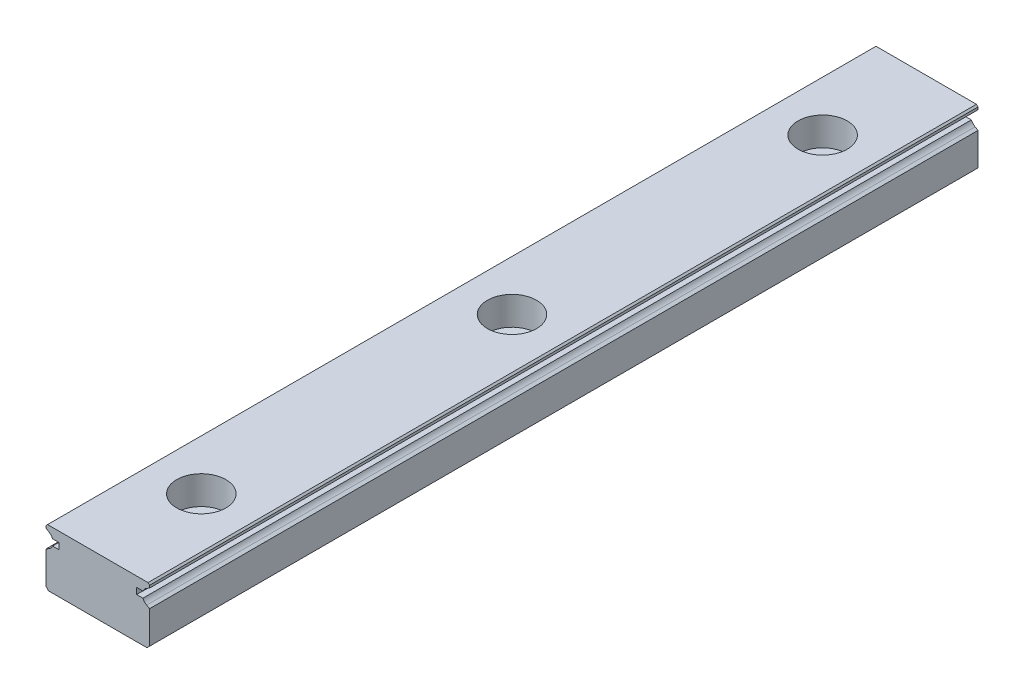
ISO-10303-21;
HEADER;
FILE_DESCRIPTION(('STEP AP214'),'2;1');
FILE_NAME('part.step','',(''),(''),'','','');
FILE_SCHEMA(('AUTOMOTIVE_DESIGN { 1 0 10303 214 1 1 1 1 }'));
ENDSEC;
DATA;
#1=APPLICATION_CONTEXT('core data for automotive mechanical design processes');
#2=APPLICATION_PROTOCOL_DEFINITION('international standard','automotive_design',2000,#1);
#3=PRODUCT_CONTEXT('',#1,'mechanical');
#4=PRODUCT('Part','Part','',(#3));
#5=PRODUCT_RELATED_PRODUCT_CATEGORY('part','',(#4));
#6=PRODUCT_DEFINITION_FORMATION('','',#4);
#7=PRODUCT_DEFINITION_CONTEXT('part definition',#1,'design');
#8=PRODUCT_DEFINITION('design','',#6,#7);
#9=PRODUCT_DEFINITION_SHAPE('','',#8);
#10=(LENGTH_UNIT() NAMED_UNIT(*) SI_UNIT(.MILLI.,.METRE.));
#11=(NAMED_UNIT(*) PLANE_ANGLE_UNIT() SI_UNIT($,.RADIAN.));
#12=(NAMED_UNIT(*) SI_UNIT($,.STERADIAN.) SOLID_ANGLE_UNIT());
#13=UNCERTAINTY_MEASURE_WITH_UNIT(LENGTH_MEASURE(1.E-05),#10,'distance_accuracy_value','');
#14=(GEOMETRIC_REPRESENTATION_CONTEXT(3) GLOBAL_UNCERTAINTY_ASSIGNED_CONTEXT((#13)) GLOBAL_UNIT_ASSIGNED_CONTEXT((#10,
#11,#12)) REPRESENTATION_CONTEXT('',''));
#15=CARTESIAN_POINT('',(0.,0.,0.));
#16=DIRECTION('',(0.,0.,1.));
#17=DIRECTION('',(1.,0.,0.));
#18=AXIS2_PLACEMENT_3D('',#15,#16,#17);
#19=CARTESIAN_POINT('',(-10.,10.7,80.));
#20=DIRECTION('',(1.,0.,0.));
#21=DIRECTION('',(0.,-1.,0.));
#22=AXIS2_PLACEMENT_3D('',#19,#20,#21);
#23=PLANE('',#22);
#24=DIRECTION('',(0.,-1.,0.));
#25=VECTOR('',#24,1.);
#26=CARTESIAN_POINT('',(-10.,10.7,-80.));
#27=LINE('',#26,#25);
#28=CARTESIAN_POINT('',(-10.,10.7,-80.));
#29=VERTEX_POINT('',#28);
#30=CARTESIAN_POINT('',(-10.,10.22385,-80.));
#31=VERTEX_POINT('',#30);
#32=EDGE_CURVE('E10',#29,#31,#27,.T.);
#33=ORIENTED_EDGE('',*,*,#32,.T.);
#34=DIRECTION('',(0.,0.,-1.));
#35=VECTOR('',#34,1.);
#36=CARTESIAN_POINT('',(-10.,10.22385,80.));
#37=LINE('',#36,#35);
#38=CARTESIAN_POINT('',(-10.,10.22385,80.));
#39=VERTEX_POINT('',#38);
#40=EDGE_CURVE('E41',#39,#31,#37,.T.);
#41=ORIENTED_EDGE('',*,*,#40,.F.);
#42=DIRECTION('',(0.,-1.,0.));
#43=VECTOR('',#42,1.);
#44=CARTESIAN_POINT('',(-10.,10.7,80.));
#45=LINE('',#44,#43);
#46=CARTESIAN_POINT('',(-10.,10.7,80.));
#47=VERTEX_POINT('',#46);
#48=EDGE_CURVE('E213',#47,#39,#45,.T.);
#49=ORIENTED_EDGE('',*,*,#48,.F.);
#50=DIRECTION('',(0.,0.,-1.));
#51=VECTOR('',#50,1.);
#52=CARTESIAN_POINT('',(-10.,10.7,80.));
#53=LINE('',#52,#51);
#54=EDGE_CURVE('E27',#47,#29,#53,.T.);
#55=ORIENTED_EDGE('',*,*,#54,.T.);
#56=EDGE_LOOP('',(#33,#41,#49,#55));
#57=FACE_BOUND('',#56,.T.);
#58=ADVANCED_FACE('F16',(#57),#23,.F.);
#59=CARTESIAN_POINT('',(-10.,10.22385,80.));
#60=DIRECTION('',(0.499987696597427,0.8660325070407,0.));
#61=DIRECTION('',(0.,0.,-1.));
#62=AXIS2_PLACEMENT_3D('',#59,#60,#61);
#63=PLANE('',#62);
#64=DIRECTION('',(0.8660325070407,-0.499987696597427,0.));
#65=VECTOR('',#64,1.);
#66=CARTESIAN_POINT('',(-10.,10.22385,-80.));
#67=LINE('',#66,#65);
#68=CARTESIAN_POINT('',(-9.44002153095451,9.90055688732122,-80.));
#69=VERTEX_POINT('',#68);
#70=EDGE_CURVE('E316',#31,#69,#67,.T.);
#71=ORIENTED_EDGE('',*,*,#70,.T.);
#72=DIRECTION('',(0.,0.,-1.));
#73=VECTOR('',#72,1.);
#74=CARTESIAN_POINT('',(-9.44002153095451,9.90055688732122,80.));
#75=LINE('',#74,#73);
#76=CARTESIAN_POINT('',(-9.44002153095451,9.90055688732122,80.));
#77=VERTEX_POINT('',#76);
#78=EDGE_CURVE('E250',#77,#69,#75,.T.);
#79=ORIENTED_EDGE('',*,*,#78,.F.);
#80=DIRECTION('',(0.8660325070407,-0.499987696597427,0.));
#81=VECTOR('',#80,1.);
#82=CARTESIAN_POINT('',(-10.,10.22385,80.));
#83=LINE('',#82,#81);
#84=EDGE_CURVE('E223',#39,#77,#83,.T.);
#85=ORIENTED_EDGE('',*,*,#84,.F.);
#86=ORIENTED_EDGE('',*,*,#40,.T.);
#87=EDGE_LOOP('',(#71,#79,#85,#86));
#88=FACE_BOUND('',#87,.T.);
#89=ADVANCED_FACE('F823',(#88),#63,.F.);
#90=CARTESIAN_POINT('',(-10.315,8.385,80.));
#91=DIRECTION('',(0.,0.,-1.));
#92=DIRECTION('',(-1.,0.,0.));
#93=AXIS2_PLACEMENT_3D('',#90,#91,#92);
#94=CYLINDRICAL_SURFACE('',#93,1.75);
#95=CARTESIAN_POINT('',(-10.315,8.385,-80.));
#96=DIRECTION('',(0.,0.,1.));
#97=DIRECTION('',(1.,0.,0.));
#98=AXIS2_PLACEMENT_3D('',#95,#96,#97);
#99=CIRCLE('',#98,1.75);
#100=CARTESIAN_POINT('',(-8.71772888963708,9.1,-80.));
#101=VERTEX_POINT('',#100);
#102=EDGE_CURVE('E270',#101,#69,#99,.T.);
#103=ORIENTED_EDGE('',*,*,#102,.F.);
#104=DIRECTION('',(0.,0.,-1.));
#105=VECTOR('',#104,1.);
#106=CARTESIAN_POINT('',(-8.71772888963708,9.1,80.));
#107=LINE('',#106,#105);
#108=CARTESIAN_POINT('',(-8.71772888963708,9.1,80.));
#109=VERTEX_POINT('',#108);
#110=EDGE_CURVE('E251',#109,#101,#107,.T.);
#111=ORIENTED_EDGE('',*,*,#110,.F.);
#112=CARTESIAN_POINT('',(-10.315,8.385,80.));
#113=DIRECTION('',(0.,0.,1.));
#114=DIRECTION('',(1.,0.,0.));
#115=AXIS2_PLACEMENT_3D('',#112,#113,#114);
#116=CIRCLE('',#115,1.75);
#117=EDGE_CURVE('E299',#109,#77,#116,.T.);
#118=ORIENTED_EDGE('',*,*,#117,.T.);
#119=ORIENTED_EDGE('',*,*,#78,.T.);
#120=EDGE_LOOP('',(#103,#111,#118,#119));
#121=FACE_BOUND('',#120,.T.);
#122=ADVANCED_FACE('F572',(#121),#94,.F.);
#123=CARTESIAN_POINT('',(-8.71772888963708,9.1,80.));
#124=DIRECTION('',(0.,1.,0.));
#125=DIRECTION('',(1.,0.,0.));
#126=AXIS2_PLACEMENT_3D('',#123,#124,#125);
#127=PLANE('',#126);
#128=DIRECTION('',(1.,0.,0.));
#129=VECTOR('',#128,1.);
#130=CARTESIAN_POINT('',(-8.71772888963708,9.1,-80.));
#131=LINE('',#130,#129);
#132=CARTESIAN_POINT('',(-7.5,9.1,-80.));
#133=VERTEX_POINT('',#132);
#134=EDGE_CURVE('E246',#101,#133,#131,.T.);
#135=ORIENTED_EDGE('',*,*,#134,.T.);
#136=DIRECTION('',(0.,0.,-1.));
#137=VECTOR('',#136,1.);
#138=CARTESIAN_POINT('',(-7.5,9.1,80.));
#139=LINE('',#138,#137);
#140=CARTESIAN_POINT('',(-7.5,9.1,80.));
#141=VERTEX_POINT('',#140);
#142=EDGE_CURVE('E355',#141,#133,#139,.T.);
#143=ORIENTED_EDGE('',*,*,#142,.F.);
#144=DIRECTION('',(1.,0.,0.));
#145=VECTOR('',#144,1.);
#146=CARTESIAN_POINT('',(-8.71772888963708,9.1,80.));
#147=LINE('',#146,#145);
#148=EDGE_CURVE('E219',#109,#141,#147,.T.);
#149=ORIENTED_EDGE('',*,*,#148,.F.);
#150=ORIENTED_EDGE('',*,*,#110,.T.);
#151=EDGE_LOOP('',(#135,#143,#149,#150));
#152=FACE_BOUND('',#151,.T.);
#153=ADVANCED_FACE('F18',(#152),#127,.F.);
#154=CARTESIAN_POINT('',(-7.5,9.1,80.));
#155=DIRECTION('',(1.,0.,0.));
#156=DIRECTION('',(0.,1.,0.));
#157=AXIS2_PLACEMENT_3D('',#154,#155,#156);
#158=PLANE('',#157);
#159=DIRECTION('',(0.,-1.,0.));
#160=VECTOR('',#159,1.);
#161=CARTESIAN_POINT('',(-7.5,9.1,-80.));
#162=LINE('',#161,#160);
#163=CARTESIAN_POINT('',(-7.5,7.9,-80.));
#164=VERTEX_POINT('',#163);
#165=EDGE_CURVE('E269',#133,#164,#162,.T.);
#166=ORIENTED_EDGE('',*,*,#165,.T.);
#167=DIRECTION('',(0.,0.,-1.));
#168=VECTOR('',#167,1.);
#169=CARTESIAN_POINT('',(-7.5,7.9,80.));
#170=LINE('',#169,#168);
#171=CARTESIAN_POINT('',(-7.5,7.9,80.));
#172=VERTEX_POINT('',#171);
#173=EDGE_CURVE('E356',#172,#164,#170,.T.);
#174=ORIENTED_EDGE('',*,*,#173,.F.);
#175=DIRECTION('',(0.,-1.,0.));
#176=VECTOR('',#175,1.);
#177=CARTESIAN_POINT('',(-7.5,9.1,80.));
#178=LINE('',#177,#176);
#179=EDGE_CURVE('E177',#141,#172,#178,.T.);
#180=ORIENTED_EDGE('',*,*,#179,.F.);
#181=ORIENTED_EDGE('',*,*,#142,.T.);
#182=EDGE_LOOP('',(#166,#174,#180,#181));
#183=FACE_BOUND('',#182,.T.);
#184=ADVANCED_FACE('F571',(#183),#158,.F.);
#185=CARTESIAN_POINT('',(-7.5,7.9,80.));
#186=DIRECTION('',(0.,-1.,0.));
#187=DIRECTION('',(-1.,0.,0.));
#188=AXIS2_PLACEMENT_3D('',#185,#186,#187);
#189=PLANE('',#188);
#190=DIRECTION('',(-1.,0.,0.));
#191=VECTOR('',#190,1.);
#192=CARTESIAN_POINT('',(-7.5,7.9,-80.));
#193=LINE('',#192,#191);
#194=CARTESIAN_POINT('',(-8.71772888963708,7.9,-80.));
#195=VERTEX_POINT('',#194);
#196=EDGE_CURVE('E351',#164,#195,#193,.T.);
#197=ORIENTED_EDGE('',*,*,#196,.T.);
#198=DIRECTION('',(0.,0.,-1.));
#199=VECTOR('',#198,1.);
#200=CARTESIAN_POINT('',(-8.71772888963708,7.9,80.));
#201=LINE('',#200,#199);
#202=CARTESIAN_POINT('',(-8.71772888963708,7.9,80.));
#203=VERTEX_POINT('',#202);
#204=EDGE_CURVE('E300',#203,#195,#201,.T.);
#205=ORIENTED_EDGE('',*,*,#204,.F.);
#206=DIRECTION('',(-1.,0.,0.));
#207=VECTOR('',#206,1.);
#208=CARTESIAN_POINT('',(-7.5,7.9,80.));
#209=LINE('',#208,#207);
#210=EDGE_CURVE('E420',#172,#203,#209,.T.);
#211=ORIENTED_EDGE('',*,*,#210,.F.);
#212=ORIENTED_EDGE('',*,*,#173,.T.);
#213=EDGE_LOOP('',(#197,#205,#211,#212));
#214=FACE_BOUND('',#213,.T.);
#215=ADVANCED_FACE('F628',(#214),#189,.F.);
#216=CARTESIAN_POINT('',(-10.315,8.615,80.));
#217=DIRECTION('',(0.,0.,-1.));
#218=DIRECTION('',(-1.,0.,0.));
#219=AXIS2_PLACEMENT_3D('',#216,#217,#218);
#220=CYLINDRICAL_SURFACE('',#219,1.75);
#221=CARTESIAN_POINT('',(-10.315,8.615,-80.));
#222=DIRECTION('',(0.,0.,1.));
#223=DIRECTION('',(1.,0.,0.));
#224=AXIS2_PLACEMENT_3D('',#221,#222,#223);
#225=CIRCLE('',#224,1.75);
#226=CARTESIAN_POINT('',(-9.4400215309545,7.09944311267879,-80.));
#227=VERTEX_POINT('',#226);
#228=EDGE_CURVE('E274',#227,#195,#225,.T.);
#229=ORIENTED_EDGE('',*,*,#228,.F.);
#230=DIRECTION('',(0.,0.,-1.));
#231=VECTOR('',#230,1.);
#232=CARTESIAN_POINT('',(-9.4400215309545,7.09944311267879,80.));
#233=LINE('',#232,#231);
#234=CARTESIAN_POINT('',(-9.4400215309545,7.09944311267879,80.));
#235=VERTEX_POINT('',#234);
#236=EDGE_CURVE('E189',#235,#227,#233,.T.);
#237=ORIENTED_EDGE('',*,*,#236,.F.);
#238=CARTESIAN_POINT('',(-10.315,8.615,80.));
#239=DIRECTION('',(0.,0.,1.));
#240=DIRECTION('',(1.,0.,0.));
#241=AXIS2_PLACEMENT_3D('',#238,#239,#240);
#242=CIRCLE('',#241,1.75);
#243=EDGE_CURVE('E304',#235,#203,#242,.T.);
#244=ORIENTED_EDGE('',*,*,#243,.T.);
#245=ORIENTED_EDGE('',*,*,#204,.T.);
#246=EDGE_LOOP('',(#229,#237,#244,#245));
#247=FACE_BOUND('',#246,.T.);
#248=ADVANCED_FACE('F605',(#247),#220,.F.);
#249=CARTESIAN_POINT('',(-9.4400215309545,7.09944311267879,80.));
#250=DIRECTION('',(0.499987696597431,-0.866032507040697,0.));
#251=DIRECTION('',(0.,0.,-1.));
#252=AXIS2_PLACEMENT_3D('',#249,#250,#251);
#253=PLANE('',#252);
#254=DIRECTION('',(-0.866032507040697,-0.499987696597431,0.));
#255=VECTOR('',#254,1.);
#256=CARTESIAN_POINT('',(-9.4400215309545,7.09944311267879,-80.));
#257=LINE('',#256,#255);
#258=CARTESIAN_POINT('',(-10.,6.77615,-80.));
#259=VERTEX_POINT('',#258);
#260=EDGE_CURVE('E305',#227,#259,#257,.T.);
#261=ORIENTED_EDGE('',*,*,#260,.T.);
#262=DIRECTION('',(0.,0.,-1.));
#263=VECTOR('',#262,1.);
#264=CARTESIAN_POINT('',(-10.,6.77615,80.));
#265=LINE('',#264,#263);
#266=CARTESIAN_POINT('',(-10.,6.77615,80.));
#267=VERTEX_POINT('',#266);
#268=EDGE_CURVE('E190',#267,#259,#265,.T.);
#269=ORIENTED_EDGE('',*,*,#268,.F.);
#270=DIRECTION('',(-0.866032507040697,-0.499987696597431,0.));
#271=VECTOR('',#270,1.);
#272=CARTESIAN_POINT('',(-9.4400215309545,7.09944311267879,80.));
#273=LINE('',#272,#271);
#274=EDGE_CURVE('E261',#235,#267,#273,.T.);
#275=ORIENTED_EDGE('',*,*,#274,.F.);
#276=ORIENTED_EDGE('',*,*,#236,.T.);
#277=EDGE_LOOP('',(#261,#269,#275,#276));
#278=FACE_BOUND('',#277,.T.);
#279=ADVANCED_FACE('F599',(#278),#253,.F.);
#280=CARTESIAN_POINT('',(-10.,6.77615,80.));
#281=DIRECTION('',(1.,0.,0.));
#282=DIRECTION('',(0.,1.,0.));
#283=AXIS2_PLACEMENT_3D('',#280,#281,#282);
#284=PLANE('',#283);
#285=DIRECTION('',(0.,-1.,0.));
#286=VECTOR('',#285,1.);
#287=CARTESIAN_POINT('',(-10.,6.77615,-80.));
#288=LINE('',#287,#286);
#289=CARTESIAN_POINT('',(-10.,0.5,-80.));
#290=VERTEX_POINT('',#289);
#291=EDGE_CURVE('E185',#259,#290,#288,.T.);
#292=ORIENTED_EDGE('',*,*,#291,.T.);
#293=DIRECTION('',(0.,0.,-1.));
#294=VECTOR('',#293,1.);
#295=CARTESIAN_POINT('',(-10.,0.5,80.));
#296=LINE('',#295,#294);
#297=CARTESIAN_POINT('',(-10.,0.5,80.));
#298=VERTEX_POINT('',#297);
#299=EDGE_CURVE('E218',#298,#290,#296,.T.);
#300=ORIENTED_EDGE('',*,*,#299,.F.);
#301=DIRECTION('',(0.,-1.,0.));
#302=VECTOR('',#301,1.);
#303=CARTESIAN_POINT('',(-10.,6.77615,80.));
#304=LINE('',#303,#302);
#305=EDGE_CURVE('E257',#267,#298,#304,.T.);
#306=ORIENTED_EDGE('',*,*,#305,.F.);
#307=ORIENTED_EDGE('',*,*,#268,.T.);
#308=EDGE_LOOP('',(#292,#300,#306,#307));
#309=FACE_BOUND('',#308,.T.);
#310=ADVANCED_FACE('F604',(#309),#284,.F.);
#311=CARTESIAN_POINT('',(-10.,0.5,80.));
#312=DIRECTION('',(0.707106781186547,0.707106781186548,0.));
#313=DIRECTION('',(0.,0.,-1.));
#314=AXIS2_PLACEMENT_3D('',#311,#312,#313);
#315=PLANE('',#314);
#316=DIRECTION('',(0.707106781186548,-0.707106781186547,0.));
#317=VECTOR('',#316,1.);
#318=CARTESIAN_POINT('',(-10.,0.5,-80.));
#319=LINE('',#318,#317);
#320=CARTESIAN_POINT('',(-9.5,0.,-80.));
#321=VERTEX_POINT('',#320);
#322=EDGE_CURVE('E357',#290,#321,#319,.T.);
#323=ORIENTED_EDGE('',*,*,#322,.T.);
#324=DIRECTION('',(0.,0.,-1.));
#325=VECTOR('',#324,1.);
#326=CARTESIAN_POINT('',(-9.5,0.,80.));
#327=LINE('',#326,#325);
#328=CARTESIAN_POINT('',(-9.5,0.,80.));
#329=VERTEX_POINT('',#328);
#330=EDGE_CURVE('E182',#329,#321,#327,.T.);
#331=ORIENTED_EDGE('',*,*,#330,.F.);
#332=DIRECTION('',(0.707106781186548,-0.707106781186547,0.));
#333=VECTOR('',#332,1.);
#334=CARTESIAN_POINT('',(-10.,0.5,80.));
#335=LINE('',#334,#333);
#336=EDGE_CURVE('E262',#298,#329,#335,.T.);
#337=ORIENTED_EDGE('',*,*,#336,.F.);
#338=ORIENTED_EDGE('',*,*,#299,.T.);
#339=EDGE_LOOP('',(#323,#331,#337,#338));
#340=FACE_BOUND('',#339,.T.);
#341=ADVANCED_FACE('F592',(#340),#315,.F.);
#342=CARTESIAN_POINT('',(-9.5,0.,80.));
#343=DIRECTION('',(0.,1.,0.));
#344=DIRECTION('',(1.,0.,0.));
#345=AXIS2_PLACEMENT_3D('',#342,#343,#344);
#346=PLANE('',#345);
#347=CARTESIAN_POINT('',(0.,0.,0.));
#348=DIRECTION('',(0.,-1.,0.));
#349=DIRECTION('',(0.,0.,-1.));
#350=AXIS2_PLACEMENT_3D('',#347,#348,#349);
#351=CIRCLE('',#350,3.);
#352=CARTESIAN_POINT('',(0.,0.,-3.));
#353=VERTEX_POINT('',#352);
#354=EDGE_CURVE('E283',#353,#353,#351,.T.);
#355=ORIENTED_EDGE('',*,*,#354,.F.);
#356=EDGE_LOOP('',(#355));
#357=FACE_BOUND('',#356,.T.);
#358=CARTESIAN_POINT('',(0.,0.,60.));
#359=DIRECTION('',(0.,-1.,0.));
#360=DIRECTION('',(0.,0.,-1.));
#361=AXIS2_PLACEMENT_3D('',#358,#359,#360);
#362=CIRCLE('',#361,3.);
#363=CARTESIAN_POINT('',(0.,0.,57.));
#364=VERTEX_POINT('',#363);
#365=EDGE_CURVE('E1074',#364,#364,#362,.T.);
#366=ORIENTED_EDGE('',*,*,#365,.F.);
#367=EDGE_LOOP('',(#366));
#368=FACE_BOUND('',#367,.T.);
#369=CARTESIAN_POINT('',(0.,0.,-60.));
#370=DIRECTION('',(0.,-1.,0.));
#371=DIRECTION('',(0.,0.,-1.));
#372=AXIS2_PLACEMENT_3D('',#369,#370,#371);
#373=CIRCLE('',#372,3.);
#374=CARTESIAN_POINT('',(0.,0.,-63.));
#375=VERTEX_POINT('',#374);
#376=EDGE_CURVE('E156',#375,#375,#373,.T.);
#377=ORIENTED_EDGE('',*,*,#376,.F.);
#378=EDGE_LOOP('',(#377));
#379=FACE_BOUND('',#378,.T.);
#380=DIRECTION('',(1.,0.,0.));
#381=VECTOR('',#380,1.);
#382=CARTESIAN_POINT('',(-9.5,0.,-80.));
#383=LINE('',#382,#381);
#384=CARTESIAN_POINT('',(9.5,0.,-80.));
#385=VERTEX_POINT('',#384);
#386=EDGE_CURVE('E214',#321,#385,#383,.T.);
#387=ORIENTED_EDGE('',*,*,#386,.T.);
#388=DIRECTION('',(0.,0.,-1.));
#389=VECTOR('',#388,1.);
#390=CARTESIAN_POINT('',(9.5,0.,80.));
#391=LINE('',#390,#389);
#392=CARTESIAN_POINT('',(9.5,0.,80.));
#393=VERTEX_POINT('',#392);
#394=EDGE_CURVE('E183',#393,#385,#391,.T.);
#395=ORIENTED_EDGE('',*,*,#394,.F.);
#396=DIRECTION('',(1.,0.,0.));
#397=VECTOR('',#396,1.);
#398=CARTESIAN_POINT('',(-9.5,0.,80.));
#399=LINE('',#398,#397);
#400=EDGE_CURVE('E288',#329,#393,#399,.T.);
#401=ORIENTED_EDGE('',*,*,#400,.F.);
#402=ORIENTED_EDGE('',*,*,#330,.T.);
#403=EDGE_LOOP('',(#387,#395,#401,#402));
#404=FACE_BOUND('',#403,.T.);
#405=ADVANCED_FACE('F157',(#357,#368,#379,#404),#346,.F.);
#406=CARTESIAN_POINT('',(9.5,0.,80.));
#407=DIRECTION('',(-0.707106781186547,0.707106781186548,0.));
#408=DIRECTION('',(0.,0.,1.));
#409=AXIS2_PLACEMENT_3D('',#406,#407,#408);
#410=PLANE('',#409);
#411=DIRECTION('',(0.707106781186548,0.707106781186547,0.));
#412=VECTOR('',#411,1.);
#413=CARTESIAN_POINT('',(9.5,0.,-80.));
#414=LINE('',#413,#412);
#415=CARTESIAN_POINT('',(10.,0.5,-80.));
#416=VERTEX_POINT('',#415);
#417=EDGE_CURVE('E179',#385,#416,#414,.T.);
#418=ORIENTED_EDGE('',*,*,#417,.T.);
#419=DIRECTION('',(0.,0.,-1.));
#420=VECTOR('',#419,1.);
#421=CARTESIAN_POINT('',(10.,0.5,80.));
#422=LINE('',#421,#420);
#423=CARTESIAN_POINT('',(10.,0.5,80.));
#424=VERTEX_POINT('',#423);
#425=EDGE_CURVE('E256',#424,#416,#422,.T.);
#426=ORIENTED_EDGE('',*,*,#425,.F.);
#427=DIRECTION('',(0.707106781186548,0.707106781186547,0.));
#428=VECTOR('',#427,1.);
#429=CARTESIAN_POINT('',(9.5,0.,80.));
#430=LINE('',#429,#428);
#431=EDGE_CURVE('E284',#393,#424,#430,.T.);
#432=ORIENTED_EDGE('',*,*,#431,.F.);
#433=ORIENTED_EDGE('',*,*,#394,.T.);
#434=EDGE_LOOP('',(#418,#426,#432,#433));
#435=FACE_BOUND('',#434,.T.);
#436=ADVANCED_FACE('F591',(#435),#410,.F.);
#437=CARTESIAN_POINT('',(10.,0.5,80.));
#438=DIRECTION('',(-1.,0.,0.));
#439=DIRECTION('',(0.,0.,1.));
#440=AXIS2_PLACEMENT_3D('',#437,#438,#439);
#441=PLANE('',#440);
#442=DIRECTION('',(0.,1.,0.));
#443=VECTOR('',#442,1.);
#444=CARTESIAN_POINT('',(10.,0.5,-80.));
#445=LINE('',#444,#443);
#446=CARTESIAN_POINT('',(10.,6.77615,-80.));
#447=VERTEX_POINT('',#446);
#448=EDGE_CURVE('E252',#416,#447,#445,.T.);
#449=ORIENTED_EDGE('',*,*,#448,.T.);
#450=DIRECTION('',(0.,0.,-1.));
#451=VECTOR('',#450,1.);
#452=CARTESIAN_POINT('',(10.,6.77615,80.));
#453=LINE('',#452,#451);
#454=CARTESIAN_POINT('',(10.,6.77615,80.));
#455=VERTEX_POINT('',#454);
#456=EDGE_CURVE('E224',#455,#447,#453,.T.);
#457=ORIENTED_EDGE('',*,*,#456,.F.);
#458=DIRECTION('',(0.,1.,0.));
#459=VECTOR('',#458,1.);
#460=CARTESIAN_POINT('',(10.,0.5,80.));
#461=LINE('',#460,#459);
#462=EDGE_CURVE('E289',#424,#455,#461,.T.);
#463=ORIENTED_EDGE('',*,*,#462,.F.);
#464=ORIENTED_EDGE('',*,*,#425,.T.);
#465=EDGE_LOOP('',(#449,#457,#463,#464));
#466=FACE_BOUND('',#465,.T.);
#467=ADVANCED_FACE('F636',(#466),#441,.F.);
#468=CARTESIAN_POINT('',(10.,6.77615,80.));
#469=DIRECTION('',(-0.499987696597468,-0.866032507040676,0.));
#470=DIRECTION('',(-0.866032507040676,0.499987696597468,0.));
#471=AXIS2_PLACEMENT_3D('',#468,#469,#470);
#472=PLANE('',#471);
#473=DIRECTION('',(-0.866032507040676,0.499987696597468,0.));
#474=VECTOR('',#473,1.);
#475=CARTESIAN_POINT('',(10.,6.77615,-80.));
#476=LINE('',#475,#474);
#477=CARTESIAN_POINT('',(9.44002153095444,7.09944311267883,-80.));
#478=VERTEX_POINT('',#477);
#479=EDGE_CURVE('E227',#447,#478,#476,.T.);
#480=ORIENTED_EDGE('',*,*,#479,.T.);
#481=DIRECTION('',(0.,0.,-1.));
#482=VECTOR('',#481,1.);
#483=CARTESIAN_POINT('',(9.44002153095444,7.09944311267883,80.));
#484=LINE('',#483,#482);
#485=CARTESIAN_POINT('',(9.44002153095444,7.09944311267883,80.));
#486=VERTEX_POINT('',#485);
#487=EDGE_CURVE('E408',#486,#478,#484,.T.);
#488=ORIENTED_EDGE('',*,*,#487,.F.);
#489=DIRECTION('',(-0.866032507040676,0.499987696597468,0.));
#490=VECTOR('',#489,1.);
#491=CARTESIAN_POINT('',(10.,6.77615,80.));
#492=LINE('',#491,#490);
#493=EDGE_CURVE('E244',#455,#486,#492,.T.);
#494=ORIENTED_EDGE('',*,*,#493,.F.);
#495=ORIENTED_EDGE('',*,*,#456,.T.);
#496=EDGE_LOOP('',(#480,#488,#494,#495));
#497=FACE_BOUND('',#496,.T.);
#498=ADVANCED_FACE('F434',(#497),#472,.F.);
#499=CARTESIAN_POINT('',(10.315,8.615,80.));
#500=DIRECTION('',(0.,0.,-1.));
#501=DIRECTION('',(-1.,0.,0.));
#502=AXIS2_PLACEMENT_3D('',#499,#500,#501);
#503=CYLINDRICAL_SURFACE('',#502,1.75);
#504=CARTESIAN_POINT('',(10.315,8.615,-80.));
#505=DIRECTION('',(0.,0.,1.));
#506=DIRECTION('',(1.,0.,0.));
#507=AXIS2_PLACEMENT_3D('',#504,#505,#506);
#508=CIRCLE('',#507,1.75);
#509=CARTESIAN_POINT('',(8.71772888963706,7.9,-80.));
#510=VERTEX_POINT('',#509);
#511=EDGE_CURVE('E315',#510,#478,#508,.T.);
#512=ORIENTED_EDGE('',*,*,#511,.F.);
#513=DIRECTION('',(0.,0.,-1.));
#514=VECTOR('',#513,1.);
#515=CARTESIAN_POINT('',(8.71772888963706,7.9,80.));
#516=LINE('',#515,#514);
#517=CARTESIAN_POINT('',(8.71772888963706,7.9,80.));
#518=VERTEX_POINT('',#517);
#519=EDGE_CURVE('E229',#518,#510,#516,.T.);
#520=ORIENTED_EDGE('',*,*,#519,.F.);
#521=CARTESIAN_POINT('',(10.315,8.615,80.));
#522=DIRECTION('',(0.,0.,1.));
#523=DIRECTION('',(1.,0.,0.));
#524=AXIS2_PLACEMENT_3D('',#521,#522,#523);
#525=CIRCLE('',#524,1.75);
#526=EDGE_CURVE('E228',#518,#486,#525,.T.);
#527=ORIENTED_EDGE('',*,*,#526,.T.);
#528=ORIENTED_EDGE('',*,*,#487,.T.);
#529=EDGE_LOOP('',(#512,#520,#527,#528));
#530=FACE_BOUND('',#529,.T.);
#531=ADVANCED_FACE('F427',(#530),#503,.F.);
#532=CARTESIAN_POINT('',(8.71772888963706,7.9,80.));
#533=DIRECTION('',(0.,-1.,0.));
#534=DIRECTION('',(-1.,0.,0.));
#535=AXIS2_PLACEMENT_3D('',#532,#533,#534);
#536=PLANE('',#535);
#537=DIRECTION('',(-1.,0.,0.));
#538=VECTOR('',#537,1.);
#539=CARTESIAN_POINT('',(8.71772888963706,7.9,-80.));
#540=LINE('',#539,#538);
#541=CARTESIAN_POINT('',(7.5,7.9,-80.));
#542=VERTEX_POINT('',#541);
#543=EDGE_CURVE('E233',#510,#542,#540,.T.);
#544=ORIENTED_EDGE('',*,*,#543,.T.);
#545=DIRECTION('',(0.,0.,-1.));
#546=VECTOR('',#545,1.);
#547=CARTESIAN_POINT('',(7.5,7.9,80.));
#548=LINE('',#547,#546);
#549=CARTESIAN_POINT('',(7.5,7.9,80.));
#550=VERTEX_POINT('',#549);
#551=EDGE_CURVE('E207',#550,#542,#548,.T.);
#552=ORIENTED_EDGE('',*,*,#551,.F.);
#553=DIRECTION('',(-1.,0.,0.));
#554=VECTOR('',#553,1.);
#555=CARTESIAN_POINT('',(8.71772888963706,7.9,80.));
#556=LINE('',#555,#554);
#557=EDGE_CURVE('E240',#518,#550,#556,.T.);
#558=ORIENTED_EDGE('',*,*,#557,.F.);
#559=ORIENTED_EDGE('',*,*,#519,.T.);
#560=EDGE_LOOP('',(#544,#552,#558,#559));
#561=FACE_BOUND('',#560,.T.);
#562=ADVANCED_FACE('F445',(#561),#536,.F.);
#563=CARTESIAN_POINT('',(7.5,7.9,80.));
#564=DIRECTION('',(-1.,0.,0.));
#565=DIRECTION('',(0.,0.,1.));
#566=AXIS2_PLACEMENT_3D('',#563,#564,#565);
#567=PLANE('',#566);
#568=DIRECTION('',(0.,1.,0.));
#569=VECTOR('',#568,1.);
#570=CARTESIAN_POINT('',(7.5,7.9,-80.));
#571=LINE('',#570,#569);
#572=CARTESIAN_POINT('',(7.5,9.1,-80.));
#573=VERTEX_POINT('',#572);
#574=EDGE_CURVE('E234',#542,#573,#571,.T.);
#575=ORIENTED_EDGE('',*,*,#574,.T.);
#576=DIRECTION('',(0.,0.,-1.));
#577=VECTOR('',#576,1.);
#578=CARTESIAN_POINT('',(7.5,9.1,80.));
#579=LINE('',#578,#577);
#580=CARTESIAN_POINT('',(7.5,9.1,80.));
#581=VERTEX_POINT('',#580);
#582=EDGE_CURVE('E208',#581,#573,#579,.T.);
#583=ORIENTED_EDGE('',*,*,#582,.F.);
#584=DIRECTION('',(0.,1.,0.));
#585=VECTOR('',#584,1.);
#586=CARTESIAN_POINT('',(7.5,7.9,80.));
#587=LINE('',#586,#585);
#588=EDGE_CURVE('E245',#550,#581,#587,.T.);
#589=ORIENTED_EDGE('',*,*,#588,.F.);
#590=ORIENTED_EDGE('',*,*,#551,.T.);
#591=EDGE_LOOP('',(#575,#583,#589,#590));
#592=FACE_BOUND('',#591,.T.);
#593=ADVANCED_FACE('F697',(#592),#567,.F.);
#594=CARTESIAN_POINT('',(7.5,9.1,80.));
#595=DIRECTION('',(0.,1.,0.));
#596=DIRECTION('',(1.,0.,0.));
#597=AXIS2_PLACEMENT_3D('',#594,#595,#596);
#598=PLANE('',#597);
#599=DIRECTION('',(1.,0.,0.));
#600=VECTOR('',#599,1.);
#601=CARTESIAN_POINT('',(7.5,9.1,-80.));
#602=LINE('',#601,#600);
#603=CARTESIAN_POINT('',(8.71772888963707,9.1,-80.));
#604=VERTEX_POINT('',#603);
#605=EDGE_CURVE('E203',#573,#604,#602,.T.);
#606=ORIENTED_EDGE('',*,*,#605,.T.);
#607=DIRECTION('',(0.,0.,-1.));
#608=VECTOR('',#607,1.);
#609=CARTESIAN_POINT('',(8.71772888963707,9.1,80.));
#610=LINE('',#609,#608);
#611=CARTESIAN_POINT('',(8.71772888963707,9.1,80.));
#612=VERTEX_POINT('',#611);
#613=EDGE_CURVE('E239',#612,#604,#610,.T.);
#614=ORIENTED_EDGE('',*,*,#613,.F.);
#615=DIRECTION('',(1.,0.,0.));
#616=VECTOR('',#615,1.);
#617=CARTESIAN_POINT('',(7.5,9.1,80.));
#618=LINE('',#617,#616);
#619=EDGE_CURVE('E330',#581,#612,#618,.T.);
#620=ORIENTED_EDGE('',*,*,#619,.F.);
#621=ORIENTED_EDGE('',*,*,#582,.T.);
#622=EDGE_LOOP('',(#606,#614,#620,#621));
#623=FACE_BOUND('',#622,.T.);
#624=ADVANCED_FACE('F691',(#623),#598,.F.);
#625=CARTESIAN_POINT('',(10.315,8.385,80.));
#626=DIRECTION('',(0.,0.,-1.));
#627=DIRECTION('',(-1.,0.,0.));
#628=AXIS2_PLACEMENT_3D('',#625,#626,#627);
#629=CYLINDRICAL_SURFACE('',#628,1.75);
#630=CARTESIAN_POINT('',(10.315,8.385,-80.));
#631=DIRECTION('',(0.,0.,1.));
#632=DIRECTION('',(1.,0.,0.));
#633=AXIS2_PLACEMENT_3D('',#630,#631,#632);
#634=CIRCLE('',#633,1.75);
#635=CARTESIAN_POINT('',(9.44002153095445,9.90055688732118,-80.));
#636=VERTEX_POINT('',#635);
#637=EDGE_CURVE('E202',#636,#604,#634,.T.);
#638=ORIENTED_EDGE('',*,*,#637,.F.);
#639=DIRECTION('',(0.,0.,-1.));
#640=VECTOR('',#639,1.);
#641=CARTESIAN_POINT('',(9.44002153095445,9.90055688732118,80.));
#642=LINE('',#641,#640);
#643=CARTESIAN_POINT('',(9.44002153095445,9.90055688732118,80.));
#644=VERTEX_POINT('',#643);
#645=EDGE_CURVE('E349',#644,#636,#642,.T.);
#646=ORIENTED_EDGE('',*,*,#645,.F.);
#647=CARTESIAN_POINT('',(10.315,8.385,80.));
#648=DIRECTION('',(0.,0.,1.));
#649=DIRECTION('',(1.,0.,0.));
#650=AXIS2_PLACEMENT_3D('',#647,#648,#649);
#651=CIRCLE('',#650,1.75);
#652=EDGE_CURVE('E235',#644,#612,#651,.T.);
#653=ORIENTED_EDGE('',*,*,#652,.T.);
#654=ORIENTED_EDGE('',*,*,#613,.T.);
#655=EDGE_LOOP('',(#638,#646,#653,#654));
#656=FACE_BOUND('',#655,.T.);
#657=ADVANCED_FACE('F696',(#656),#629,.F.);
#658=CARTESIAN_POINT('',(9.44002153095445,9.90055688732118,80.));
#659=DIRECTION('',(-0.499987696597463,0.866032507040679,0.));
#660=DIRECTION('',(0.,0.,1.));
#661=AXIS2_PLACEMENT_3D('',#658,#659,#660);
#662=PLANE('',#661);
#663=DIRECTION('',(0.866032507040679,0.499987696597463,0.));
#664=VECTOR('',#663,1.);
#665=CARTESIAN_POINT('',(9.44002153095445,9.90055688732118,-80.));
#666=LINE('',#665,#664);
#667=CARTESIAN_POINT('',(10.,10.22385,-80.));
#668=VERTEX_POINT('',#667);
#669=EDGE_CURVE('E340',#636,#668,#666,.T.);
#670=ORIENTED_EDGE('',*,*,#669,.T.);
#671=DIRECTION('',(0.,0.,-1.));
#672=VECTOR('',#671,1.);
#673=CARTESIAN_POINT('',(10.,10.22385,80.));
#674=LINE('',#673,#672);
#675=CARTESIAN_POINT('',(10.,10.22385,80.));
#676=VERTEX_POINT('',#675);
#677=EDGE_CURVE('E350',#676,#668,#674,.T.);
#678=ORIENTED_EDGE('',*,*,#677,.F.);
#679=DIRECTION('',(0.866032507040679,0.499987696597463,0.));
#680=VECTOR('',#679,1.);
#681=CARTESIAN_POINT('',(9.44002153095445,9.90055688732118,80.));
#682=LINE('',#681,#680);
#683=EDGE_CURVE('E195',#644,#676,#682,.T.);
#684=ORIENTED_EDGE('',*,*,#683,.F.);
#685=ORIENTED_EDGE('',*,*,#645,.T.);
#686=EDGE_LOOP('',(#670,#678,#684,#685));
#687=FACE_BOUND('',#686,.T.);
#688=ADVANCED_FACE('F733',(#687),#662,.F.);
#689=CARTESIAN_POINT('',(10.,10.22385,80.));
#690=DIRECTION('',(-1.,0.,0.));
#691=DIRECTION('',(0.,1.,0.));
#692=AXIS2_PLACEMENT_3D('',#689,#690,#691);
#693=PLANE('',#692);
#694=DIRECTION('',(0.,1.,0.));
#695=VECTOR('',#694,1.);
#696=CARTESIAN_POINT('',(10.,10.22385,-80.));
#697=LINE('',#696,#695);
#698=CARTESIAN_POINT('',(10.,10.7,-80.));
#699=VERTEX_POINT('',#698);
#700=EDGE_CURVE('E345',#668,#699,#697,.T.);
#701=ORIENTED_EDGE('',*,*,#700,.T.);
#702=DIRECTION('',(0.,0.,-1.));
#703=VECTOR('',#702,1.);
#704=CARTESIAN_POINT('',(10.,10.7,80.));
#705=LINE('',#704,#703);
#706=CARTESIAN_POINT('',(10.,10.7,80.));
#707=VERTEX_POINT('',#706);
#708=EDGE_CURVE('E20',#707,#699,#705,.T.);
#709=ORIENTED_EDGE('',*,*,#708,.F.);
#710=DIRECTION('',(0.,1.,0.));
#711=VECTOR('',#710,1.);
#712=CARTESIAN_POINT('',(10.,10.22385,80.));
#713=LINE('',#712,#711);
#714=EDGE_CURVE('E191',#676,#707,#713,.T.);
#715=ORIENTED_EDGE('',*,*,#714,.F.);
#716=ORIENTED_EDGE('',*,*,#677,.T.);
#717=EDGE_LOOP('',(#701,#709,#715,#716));
#718=FACE_BOUND('',#717,.T.);
#719=ADVANCED_FACE('F648',(#718),#693,.F.);
#720=CARTESIAN_POINT('',(10.,10.7,80.));
#721=DIRECTION('',(-0.707106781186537,-0.707106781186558,0.));
#722=DIRECTION('',(-0.707106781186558,0.707106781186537,0.));
#723=AXIS2_PLACEMENT_3D('',#720,#721,#722);
#724=PLANE('',#723);
#725=DIRECTION('',(-0.707106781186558,0.707106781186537,0.));
#726=VECTOR('',#725,1.);
#727=CARTESIAN_POINT('',(10.,10.7,-80.));
#728=LINE('',#727,#726);
#729=CARTESIAN_POINT('',(9.7,11.,-80.));
#730=VERTEX_POINT('',#729);
#731=EDGE_CURVE('E367',#699,#730,#728,.T.);
#732=ORIENTED_EDGE('',*,*,#731,.T.);
#733=DIRECTION('',(0.,0.,-1.));
#734=VECTOR('',#733,1.);
#735=CARTESIAN_POINT('',(9.7,11.,80.));
#736=LINE('',#735,#734);
#737=CARTESIAN_POINT('',(9.7,11.,80.));
#738=VERTEX_POINT('',#737);
#739=EDGE_CURVE('E295',#738,#730,#736,.T.);
#740=ORIENTED_EDGE('',*,*,#739,.F.);
#741=DIRECTION('',(-0.707106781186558,0.707106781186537,0.));
#742=VECTOR('',#741,1.);
#743=CARTESIAN_POINT('',(10.,10.7,80.));
#744=LINE('',#743,#742);
#745=EDGE_CURVE('E196',#707,#738,#744,.T.);
#746=ORIENTED_EDGE('',*,*,#745,.F.);
#747=ORIENTED_EDGE('',*,*,#708,.T.);
#748=EDGE_LOOP('',(#732,#740,#746,#747));
#749=FACE_BOUND('',#748,.T.);
#750=ADVANCED_FACE('F642',(#749),#724,.F.);
#751=CARTESIAN_POINT('',(9.7,11.,80.));
#752=DIRECTION('',(0.,-1.,0.));
#753=DIRECTION('',(0.,0.,-1.));
#754=AXIS2_PLACEMENT_3D('',#751,#752,#753);
#755=PLANE('',#754);
#756=CARTESIAN_POINT('',(0.,11.,0.));
#757=DIRECTION('',(0.,-1.,0.));
#758=DIRECTION('',(0.,0.,-1.));
#759=AXIS2_PLACEMENT_3D('',#756,#757,#758);
#760=CIRCLE('',#759,4.75);
#761=CARTESIAN_POINT('',(0.,11.,-4.75));
#762=VERTEX_POINT('',#761);
#763=EDGE_CURVE('E344',#762,#762,#760,.T.);
#764=ORIENTED_EDGE('',*,*,#763,.T.);
#765=EDGE_LOOP('',(#764));
#766=FACE_BOUND('',#765,.T.);
#767=CARTESIAN_POINT('',(0.,11.,60.));
#768=DIRECTION('',(0.,-1.,0.));
#769=DIRECTION('',(0.,0.,-1.));
#770=AXIS2_PLACEMENT_3D('',#767,#768,#769);
#771=CIRCLE('',#770,4.75);
#772=CARTESIAN_POINT('',(0.,11.,55.25));
#773=VERTEX_POINT('',#772);
#774=EDGE_CURVE('E311',#773,#773,#771,.T.);
#775=ORIENTED_EDGE('',*,*,#774,.T.);
#776=EDGE_LOOP('',(#775));
#777=FACE_BOUND('',#776,.T.);
#778=CARTESIAN_POINT('',(0.,11.,-60.));
#779=DIRECTION('',(0.,-1.,0.));
#780=DIRECTION('',(0.,0.,-1.));
#781=AXIS2_PLACEMENT_3D('',#778,#779,#780);
#782=CIRCLE('',#781,4.75);
#783=CARTESIAN_POINT('',(0.,11.,-64.75));
#784=VERTEX_POINT('',#783);
#785=EDGE_CURVE('E294',#784,#784,#782,.T.);
#786=ORIENTED_EDGE('',*,*,#785,.T.);
#787=EDGE_LOOP('',(#786));
#788=FACE_BOUND('',#787,.T.);
#789=DIRECTION('',(-1.,0.,0.));
#790=VECTOR('',#789,1.);
#791=CARTESIAN_POINT('',(9.7,11.,-80.));
#792=LINE('',#791,#790);
#793=CARTESIAN_POINT('',(-9.7,11.,-80.));
#794=VERTEX_POINT('',#793);
#795=EDGE_CURVE('E290',#730,#794,#792,.T.);
#796=ORIENTED_EDGE('',*,*,#795,.T.);
#797=DIRECTION('',(0.,0.,-1.));
#798=VECTOR('',#797,1.);
#799=CARTESIAN_POINT('',(-9.7,11.,80.));
#800=LINE('',#799,#798);
#801=CARTESIAN_POINT('',(-9.7,11.,80.));
#802=VERTEX_POINT('',#801);
#803=EDGE_CURVE('E209',#802,#794,#800,.T.);
#804=ORIENTED_EDGE('',*,*,#803,.F.);
#805=DIRECTION('',(-1.,0.,0.));
#806=VECTOR('',#805,1.);
#807=CARTESIAN_POINT('',(9.7,11.,80.));
#808=LINE('',#807,#806);
#809=EDGE_CURVE('E201',#738,#802,#808,.T.);
#810=ORIENTED_EDGE('',*,*,#809,.F.);
#811=ORIENTED_EDGE('',*,*,#739,.T.);
#812=EDGE_LOOP('',(#796,#804,#810,#811));
#813=FACE_BOUND('',#812,.T.);
#814=ADVANCED_FACE('F647',(#766,#777,#788,#813),#755,.F.);
#815=CARTESIAN_POINT('',(-9.7,11.,80.));
#816=DIRECTION('',(0.707106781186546,-0.70710678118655,0.));
#817=DIRECTION('',(0.,0.,-1.));
#818=AXIS2_PLACEMENT_3D('',#815,#816,#817);
#819=PLANE('',#818);
#820=DIRECTION('',(-0.70710678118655,-0.707106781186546,0.));
#821=VECTOR('',#820,1.);
#822=CARTESIAN_POINT('',(-9.7,11.,-80.));
#823=LINE('',#822,#821);
#824=EDGE_CURVE('E212',#794,#29,#823,.T.);
#825=ORIENTED_EDGE('',*,*,#824,.T.);
#826=ORIENTED_EDGE('',*,*,#54,.F.);
#827=DIRECTION('',(-0.70710678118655,-0.707106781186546,0.));
#828=VECTOR('',#827,1.);
#829=CARTESIAN_POINT('',(-9.7,11.,80.));
#830=LINE('',#829,#828);
#831=EDGE_CURVE('E197',#802,#47,#830,.T.);
#832=ORIENTED_EDGE('',*,*,#831,.F.);
#833=ORIENTED_EDGE('',*,*,#803,.T.);
#834=EDGE_LOOP('',(#825,#826,#832,#833));
#835=FACE_BOUND('',#834,.T.);
#836=ADVANCED_FACE('F742',(#835),#819,.F.);
#837=CARTESIAN_POINT('',(-10.315,8.385,80.));
#838=DIRECTION('',(0.,0.,1.));
#839=DIRECTION('',(1.,0.,0.));
#840=AXIS2_PLACEMENT_3D('',#837,#838,#839);
#841=PLANE('',#840);
#842=ORIENTED_EDGE('',*,*,#48,.T.);
#843=ORIENTED_EDGE('',*,*,#84,.T.);
#844=ORIENTED_EDGE('',*,*,#117,.F.);
#845=ORIENTED_EDGE('',*,*,#148,.T.);
#846=ORIENTED_EDGE('',*,*,#179,.T.);
#847=ORIENTED_EDGE('',*,*,#210,.T.);
#848=ORIENTED_EDGE('',*,*,#243,.F.);
#849=ORIENTED_EDGE('',*,*,#274,.T.);
#850=ORIENTED_EDGE('',*,*,#305,.T.);
#851=ORIENTED_EDGE('',*,*,#336,.T.);
#852=ORIENTED_EDGE('',*,*,#400,.T.);
#853=ORIENTED_EDGE('',*,*,#431,.T.);
#854=ORIENTED_EDGE('',*,*,#462,.T.);
#855=ORIENTED_EDGE('',*,*,#493,.T.);
#856=ORIENTED_EDGE('',*,*,#526,.F.);
#857=ORIENTED_EDGE('',*,*,#557,.T.);
#858=ORIENTED_EDGE('',*,*,#588,.T.);
#859=ORIENTED_EDGE('',*,*,#619,.T.);
#860=ORIENTED_EDGE('',*,*,#652,.F.);
#861=ORIENTED_EDGE('',*,*,#683,.T.);
#862=ORIENTED_EDGE('',*,*,#714,.T.);
#863=ORIENTED_EDGE('',*,*,#745,.T.);
#864=ORIENTED_EDGE('',*,*,#809,.T.);
#865=ORIENTED_EDGE('',*,*,#831,.T.);
#866=EDGE_LOOP('',(#842,#843,#844,#845,#846,#847,#848,#849,#850,#851,#852,#853,#854,#855,#856,
#857,#858,#859,#860,#861,#862,#863,#864,#865));
#867=FACE_BOUND('',#866,.T.);
#868=ADVANCED_FACE('F449',(#867),#841,.T.);
#869=CARTESIAN_POINT('',(-10.315,8.385,-80.));
#870=DIRECTION('',(0.,0.,1.));
#871=DIRECTION('',(1.,0.,0.));
#872=AXIS2_PLACEMENT_3D('',#869,#870,#871);
#873=PLANE('',#872);
#874=ORIENTED_EDGE('',*,*,#32,.F.);
#875=ORIENTED_EDGE('',*,*,#824,.F.);
#876=ORIENTED_EDGE('',*,*,#795,.F.);
#877=ORIENTED_EDGE('',*,*,#731,.F.);
#878=ORIENTED_EDGE('',*,*,#700,.F.);
#879=ORIENTED_EDGE('',*,*,#669,.F.);
#880=ORIENTED_EDGE('',*,*,#637,.T.);
#881=ORIENTED_EDGE('',*,*,#605,.F.);
#882=ORIENTED_EDGE('',*,*,#574,.F.);
#883=ORIENTED_EDGE('',*,*,#543,.F.);
#884=ORIENTED_EDGE('',*,*,#511,.T.);
#885=ORIENTED_EDGE('',*,*,#479,.F.);
#886=ORIENTED_EDGE('',*,*,#448,.F.);
#887=ORIENTED_EDGE('',*,*,#417,.F.);
#888=ORIENTED_EDGE('',*,*,#386,.F.);
#889=ORIENTED_EDGE('',*,*,#322,.F.);
#890=ORIENTED_EDGE('',*,*,#291,.F.);
#891=ORIENTED_EDGE('',*,*,#260,.F.);
#892=ORIENTED_EDGE('',*,*,#228,.T.);
#893=ORIENTED_EDGE('',*,*,#196,.F.);
#894=ORIENTED_EDGE('',*,*,#165,.F.);
#895=ORIENTED_EDGE('',*,*,#134,.F.);
#896=ORIENTED_EDGE('',*,*,#102,.T.);
#897=ORIENTED_EDGE('',*,*,#70,.F.);
#898=EDGE_LOOP('',(#874,#875,#876,#877,#878,#879,#880,#881,#882,#883,#884,#885,#886,#887,#888,
#889,#890,#891,#892,#893,#894,#895,#896,#897));
#899=FACE_BOUND('',#898,.T.);
#900=ADVANCED_FACE('F440',(#899),#873,.F.);
#901=CARTESIAN_POINT('',(0.,0.,-60.));
#902=DIRECTION('',(0.,-1.,0.));
#903=DIRECTION('',(0.,0.,-1.));
#904=AXIS2_PLACEMENT_3D('',#901,#902,#903);
#905=CYLINDRICAL_SURFACE('',#904,4.75);
#906=CARTESIAN_POINT('',(0.,5.5,-60.));
#907=DIRECTION('',(0.,-1.,0.));
#908=DIRECTION('',(0.,0.,-1.));
#909=AXIS2_PLACEMENT_3D('',#906,#907,#908);
#910=CIRCLE('',#909,4.75);
#911=CARTESIAN_POINT('',(0.,5.5,-64.75));
#912=VERTEX_POINT('',#911);
#913=EDGE_CURVE('E170',#912,#912,#910,.T.);
#914=ORIENTED_EDGE('',*,*,#913,.T.);
#915=EDGE_LOOP('',(#914));
#916=FACE_BOUND('',#915,.T.);
#917=ORIENTED_EDGE('',*,*,#785,.F.);
#918=EDGE_LOOP('',(#917));
#919=FACE_BOUND('',#918,.T.);
#920=ADVANCED_FACE('F582',(#916,#919),#905,.F.);
#921=CARTESIAN_POINT('',(0.,5.5,-64.75));
#922=DIRECTION('',(0.,1.,0.));
#923=DIRECTION('',(1.,0.,0.));
#924=AXIS2_PLACEMENT_3D('',#921,#922,#923);
#925=PLANE('',#924);
#926=CARTESIAN_POINT('',(0.,5.5,-60.));
#927=DIRECTION('',(0.,-1.,0.));
#928=DIRECTION('',(0.,0.,-1.));
#929=AXIS2_PLACEMENT_3D('',#926,#927,#928);
#930=CIRCLE('',#929,3.);
#931=CARTESIAN_POINT('',(0.,5.5,-63.));
#932=VERTEX_POINT('',#931);
#933=EDGE_CURVE('E161',#932,#932,#930,.T.);
#934=ORIENTED_EDGE('',*,*,#933,.T.);
#935=EDGE_LOOP('',(#934));
#936=FACE_BOUND('',#935,.T.);
#937=ORIENTED_EDGE('',*,*,#913,.F.);
#938=EDGE_LOOP('',(#937));
#939=FACE_BOUND('',#938,.T.);
#940=ADVANCED_FACE('F714',(#936,#939),#925,.T.);
#941=CARTESIAN_POINT('',(0.,0.,-60.));
#942=DIRECTION('',(0.,-1.,0.));
#943=DIRECTION('',(0.,0.,-1.));
#944=AXIS2_PLACEMENT_3D('',#941,#942,#943);
#945=CYLINDRICAL_SURFACE('',#944,3.);
#946=ORIENTED_EDGE('',*,*,#376,.T.);
#947=EDGE_LOOP('',(#946));
#948=FACE_BOUND('',#947,.T.);
#949=ORIENTED_EDGE('',*,*,#933,.F.);
#950=EDGE_LOOP('',(#949));
#951=FACE_BOUND('',#950,.T.);
#952=ADVANCED_FACE('F618',(#948,#951),#945,.F.);
#953=CARTESIAN_POINT('',(0.,0.,60.));
#954=DIRECTION('',(0.,-1.,0.));
#955=DIRECTION('',(0.,0.,-1.));
#956=AXIS2_PLACEMENT_3D('',#953,#954,#955);
#957=CYLINDRICAL_SURFACE('',#956,4.75);
#958=CARTESIAN_POINT('',(0.,5.5,60.));
#959=DIRECTION('',(0.,-1.,0.));
#960=DIRECTION('',(0.,0.,-1.));
#961=AXIS2_PLACEMENT_3D('',#958,#959,#960);
#962=CIRCLE('',#961,4.75);
#963=CARTESIAN_POINT('',(0.,5.5,55.25));
#964=VERTEX_POINT('',#963);
#965=EDGE_CURVE('E162',#964,#964,#962,.T.);
#966=ORIENTED_EDGE('',*,*,#965,.T.);
#967=EDGE_LOOP('',(#966));
#968=FACE_BOUND('',#967,.T.);
#969=ORIENTED_EDGE('',*,*,#774,.F.);
#970=EDGE_LOOP('',(#969));
#971=FACE_BOUND('',#970,.T.);
#972=ADVANCED_FACE('F612',(#968,#971),#957,.F.);
#973=CARTESIAN_POINT('',(0.,5.5,55.25));
#974=DIRECTION('',(0.,1.,0.));
#975=DIRECTION('',(1.,0.,0.));
#976=AXIS2_PLACEMENT_3D('',#973,#974,#975);
#977=PLANE('',#976);
#978=CARTESIAN_POINT('',(0.,5.5,60.));
#979=DIRECTION('',(0.,-1.,0.));
#980=DIRECTION('',(0.,0.,-1.));
#981=AXIS2_PLACEMENT_3D('',#978,#979,#980);
#982=CIRCLE('',#981,3.);
#983=CARTESIAN_POINT('',(0.,5.5,57.));
#984=VERTEX_POINT('',#983);
#985=EDGE_CURVE('E173',#984,#984,#982,.T.);
#986=ORIENTED_EDGE('',*,*,#985,.T.);
#987=EDGE_LOOP('',(#986));
#988=FACE_BOUND('',#987,.T.);
#989=ORIENTED_EDGE('',*,*,#965,.F.);
#990=EDGE_LOOP('',(#989));
#991=FACE_BOUND('',#990,.T.);
#992=ADVANCED_FACE('F617',(#988,#991),#977,.T.);
#993=CARTESIAN_POINT('',(0.,0.,60.));
#994=DIRECTION('',(0.,-1.,0.));
#995=DIRECTION('',(0.,0.,-1.));
#996=AXIS2_PLACEMENT_3D('',#993,#994,#995);
#997=CYLINDRICAL_SURFACE('',#996,3.);
#998=ORIENTED_EDGE('',*,*,#365,.T.);
#999=EDGE_LOOP('',(#998));
#1000=FACE_BOUND('',#999,.T.);
#1001=ORIENTED_EDGE('',*,*,#985,.F.);
#1002=EDGE_LOOP('',(#1001));
#1003=FACE_BOUND('',#1002,.T.);
#1004=ADVANCED_FACE('F684',(#1000,#1003),#997,.F.);
#1005=CARTESIAN_POINT('',(0.,0.,0.));
#1006=DIRECTION('',(0.,-1.,0.));
#1007=DIRECTION('',(0.,0.,-1.));
#1008=AXIS2_PLACEMENT_3D('',#1005,#1006,#1007);
#1009=CYLINDRICAL_SURFACE('',#1008,4.75);
#1010=CARTESIAN_POINT('',(0.,5.5,0.));
#1011=DIRECTION('',(0.,-1.,0.));
#1012=DIRECTION('',(0.,0.,-1.));
#1013=AXIS2_PLACEMENT_3D('',#1010,#1011,#1012);
#1014=CIRCLE('',#1013,4.75);
#1015=CARTESIAN_POINT('',(0.,5.5,-4.75));
#1016=VERTEX_POINT('',#1015);
#1017=EDGE_CURVE('E282',#1016,#1016,#1014,.T.);
#1018=ORIENTED_EDGE('',*,*,#1017,.T.);
#1019=EDGE_LOOP('',(#1018));
#1020=FACE_BOUND('',#1019,.T.);
#1021=ORIENTED_EDGE('',*,*,#763,.F.);
#1022=EDGE_LOOP('',(#1021));
#1023=FACE_BOUND('',#1022,.T.);
#1024=ADVANCED_FACE('F678',(#1020,#1023),#1009,.F.);
#1025=CARTESIAN_POINT('',(0.,5.5,-4.75));
#1026=DIRECTION('',(0.,1.,0.));
#1027=DIRECTION('',(1.,0.,0.));
#1028=AXIS2_PLACEMENT_3D('',#1025,#1026,#1027);
#1029=PLANE('',#1028);
#1030=CARTESIAN_POINT('',(0.,5.5,0.));
#1031=DIRECTION('',(0.,-1.,0.));
#1032=DIRECTION('',(0.,0.,-1.));
#1033=AXIS2_PLACEMENT_3D('',#1030,#1031,#1032);
#1034=CIRCLE('',#1033,3.);
#1035=CARTESIAN_POINT('',(0.,5.5,-3.));
#1036=VERTEX_POINT('',#1035);
#1037=EDGE_CURVE('E278',#1036,#1036,#1034,.T.);
#1038=ORIENTED_EDGE('',*,*,#1037,.T.);
#1039=EDGE_LOOP('',(#1038));
#1040=FACE_BOUND('',#1039,.T.);
#1041=ORIENTED_EDGE('',*,*,#1017,.F.);
#1042=EDGE_LOOP('',(#1041));
#1043=FACE_BOUND('',#1042,.T.);
#1044=ADVANCED_FACE('F683',(#1040,#1043),#1029,.T.);
#1045=CARTESIAN_POINT('',(0.,0.,0.));
#1046=DIRECTION('',(0.,-1.,0.));
#1047=DIRECTION('',(0.,0.,-1.));
#1048=AXIS2_PLACEMENT_3D('',#1045,#1046,#1047);
#1049=CYLINDRICAL_SURFACE('',#1048,3.);
#1050=ORIENTED_EDGE('',*,*,#354,.T.);
#1051=EDGE_LOOP('',(#1050));
#1052=FACE_BOUND('',#1051,.T.);
#1053=ORIENTED_EDGE('',*,*,#1037,.F.);
#1054=EDGE_LOOP('',(#1053));
#1055=FACE_BOUND('',#1054,.T.);
#1056=ADVANCED_FACE('F751',(#1052,#1055),#1049,.F.);
#1057=CLOSED_SHELL('',(#58,#89,#122,#153,#184,#215,#248,#279,#310,#341,#405,#436,#467,#498,#531,
#562,#593,#624,#657,#688,#719,#750,#814,#836,#868,#900,#920,#940,#952,#972,#992,#1004,#1024,
#1044,#1056));
#1058=MANIFOLD_SOLID_BREP('B1',#1057);
#1059=ADVANCED_BREP_SHAPE_REPRESENTATION('',(#18,#1058),#14);
#1060=SHAPE_DEFINITION_REPRESENTATION(#9,#1059);
ENDSEC;
END-ISO-10303-21;
